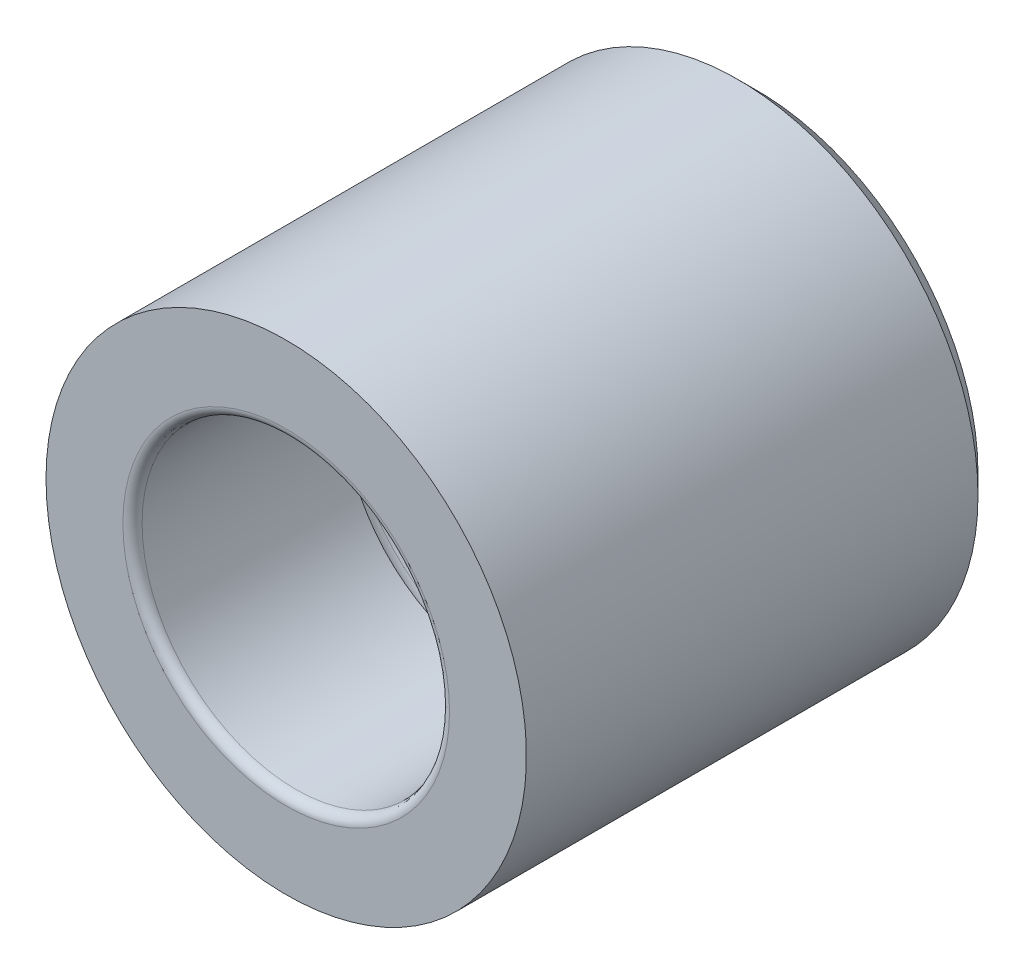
ISO-10303-21;
HEADER;
FILE_DESCRIPTION(('STEP AP214'),'2;1');
FILE_NAME('part.step','',(''),(''),'','','');
FILE_SCHEMA(('AUTOMOTIVE_DESIGN { 1 0 10303 214 1 1 1 1 }'));
ENDSEC;
DATA;
#1=APPLICATION_CONTEXT('core data for automotive mechanical design processes');
#2=APPLICATION_PROTOCOL_DEFINITION('international standard','automotive_design',2000,#1);
#3=PRODUCT_CONTEXT('',#1,'mechanical');
#4=PRODUCT('Part','Part','',(#3));
#5=PRODUCT_RELATED_PRODUCT_CATEGORY('part','',(#4));
#6=PRODUCT_DEFINITION_FORMATION('','',#4);
#7=PRODUCT_DEFINITION_CONTEXT('part definition',#1,'design');
#8=PRODUCT_DEFINITION('design','',#6,#7);
#9=PRODUCT_DEFINITION_SHAPE('','',#8);
#10=(LENGTH_UNIT() NAMED_UNIT(*) SI_UNIT(.MILLI.,.METRE.));
#11=(NAMED_UNIT(*) PLANE_ANGLE_UNIT() SI_UNIT($,.RADIAN.));
#12=(NAMED_UNIT(*) SI_UNIT($,.STERADIAN.) SOLID_ANGLE_UNIT());
#13=UNCERTAINTY_MEASURE_WITH_UNIT(LENGTH_MEASURE(1.E-05),#10,'distance_accuracy_value','');
#14=(GEOMETRIC_REPRESENTATION_CONTEXT(3) GLOBAL_UNCERTAINTY_ASSIGNED_CONTEXT((#13)) GLOBAL_UNIT_ASSIGNED_CONTEXT((#10,
#11,#12)) REPRESENTATION_CONTEXT('',''));
#15=CARTESIAN_POINT('',(0.,0.,0.));
#16=DIRECTION('',(0.,0.,1.));
#17=DIRECTION('',(1.,0.,0.));
#18=AXIS2_PLACEMENT_3D('',#15,#16,#17);
#19=CARTESIAN_POINT('',(0.,0.,-0.5));
#20=DIRECTION('',(0.,0.,-1.));
#21=DIRECTION('',(-1.,0.,0.));
#22=AXIS2_PLACEMENT_3D('',#19,#20,#21);
#23=PLANE('',#22);
#24=CARTESIAN_POINT('',(0.,0.,-0.5));
#25=DIRECTION('',(0.,0.,-1.));
#26=DIRECTION('',(-1.,0.,0.));
#27=AXIS2_PLACEMENT_3D('',#24,#25,#26);
#28=CIRCLE('',#27,8.5);
#29=CARTESIAN_POINT('',(-8.5,0.,-0.499999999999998));
#30=VERTEX_POINT('',#29);
#31=EDGE_CURVE('E50',#30,#30,#28,.T.);
#32=ORIENTED_EDGE('',*,*,#31,.T.);
#33=EDGE_LOOP('',(#32));
#34=FACE_BOUND('',#33,.T.);
#35=CARTESIAN_POINT('',(0.,0.,-0.5));
#36=DIRECTION('',(0.,0.,-1.));
#37=DIRECTION('',(-1.,0.,0.));
#38=AXIS2_PLACEMENT_3D('',#35,#36,#37);
#39=CIRCLE('',#38,12.5);
#40=CARTESIAN_POINT('',(-12.5,0.,-0.499999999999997));
#41=VERTEX_POINT('',#40);
#42=EDGE_CURVE('E63',#41,#41,#39,.T.);
#43=ORIENTED_EDGE('',*,*,#42,.F.);
#44=EDGE_LOOP('',(#43));
#45=FACE_BOUND('',#44,.T.);
#46=ADVANCED_FACE('F35',(#34,#45),#23,.F.);
#47=CARTESIAN_POINT('',(0.,0.,-0.5));
#48=DIRECTION('',(0.,0.,-1.));
#49=DIRECTION('',(-1.,0.,0.));
#50=AXIS2_PLACEMENT_3D('',#47,#48,#49);
#51=CYLINDRICAL_SURFACE('',#50,12.5);
#52=CARTESIAN_POINT('',(0.,0.,-24.));
#53=DIRECTION('',(0.,0.,1.));
#54=DIRECTION('',(1.,0.,0.));
#55=AXIS2_PLACEMENT_3D('',#52,#53,#54);
#56=CIRCLE('',#55,12.5);
#57=CARTESIAN_POINT('',(12.5,0.,-24.));
#58=VERTEX_POINT('',#57);
#59=EDGE_CURVE('E10',#58,#58,#56,.T.);
#60=ORIENTED_EDGE('',*,*,#59,.T.);
#61=EDGE_LOOP('',(#60));
#62=FACE_BOUND('',#61,.T.);
#63=ORIENTED_EDGE('',*,*,#42,.T.);
#64=EDGE_LOOP('',(#63));
#65=FACE_BOUND('',#64,.T.);
#66=ADVANCED_FACE('F79',(#62,#65),#51,.T.);
#67=CARTESIAN_POINT('',(0.,0.,-25.));
#68=DIRECTION('',(0.,0.,1.));
#69=DIRECTION('',(1.,0.,0.));
#70=AXIS2_PLACEMENT_3D('',#67,#68,#69);
#71=PLANE('',#70);
#72=CARTESIAN_POINT('',(0.,0.,-25.));
#73=DIRECTION('',(0.,0.,1.));
#74=DIRECTION('',(1.,0.,0.));
#75=AXIS2_PLACEMENT_3D('',#72,#73,#74);
#76=CIRCLE('',#75,11.5);
#77=CARTESIAN_POINT('',(11.5,0.,-25.));
#78=VERTEX_POINT('',#77);
#79=EDGE_CURVE('E42',#78,#78,#76,.F.);
#80=ORIENTED_EDGE('',*,*,#79,.T.);
#81=EDGE_LOOP('',(#80));
#82=FACE_BOUND('',#81,.T.);
#83=CARTESIAN_POINT('',(0.,0.,-25.));
#84=DIRECTION('',(0.,0.,-1.));
#85=DIRECTION('',(-1.,0.,0.));
#86=AXIS2_PLACEMENT_3D('',#83,#84,#85);
#87=CIRCLE('',#86,3.4);
#88=CARTESIAN_POINT('',(-3.4,0.,-25.));
#89=VERTEX_POINT('',#88);
#90=EDGE_CURVE('E70',#89,#89,#87,.T.);
#91=ORIENTED_EDGE('',*,*,#90,.F.);
#92=EDGE_LOOP('',(#91));
#93=FACE_BOUND('',#92,.T.);
#94=ADVANCED_FACE('F76',(#82,#93),#71,.F.);
#95=CARTESIAN_POINT('',(0.,0.,-14.));
#96=DIRECTION('',(0.,0.,1.));
#97=DIRECTION('',(1.,0.,0.));
#98=AXIS2_PLACEMENT_3D('',#95,#96,#97);
#99=PLANE('',#98);
#100=CARTESIAN_POINT('',(0.,0.,-14.));
#101=DIRECTION('',(0.,0.,1.));
#102=DIRECTION('',(1.,0.,0.));
#103=AXIS2_PLACEMENT_3D('',#100,#101,#102);
#104=CIRCLE('',#103,3.4);
#105=CARTESIAN_POINT('',(3.39999999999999,0.,-14.));
#106=VERTEX_POINT('',#105);
#107=EDGE_CURVE('E60',#106,#106,#104,.T.);
#108=ORIENTED_EDGE('',*,*,#107,.F.);
#109=EDGE_LOOP('',(#108));
#110=FACE_BOUND('',#109,.T.);
#111=CARTESIAN_POINT('',(0.,0.,-14.));
#112=DIRECTION('',(0.,0.,1.));
#113=DIRECTION('',(1.,0.,0.));
#114=AXIS2_PLACEMENT_3D('',#111,#112,#113);
#115=CIRCLE('',#114,8.);
#116=CARTESIAN_POINT('',(7.99999999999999,0.,-14.));
#117=VERTEX_POINT('',#116);
#118=EDGE_CURVE('E55',#117,#117,#115,.T.);
#119=ORIENTED_EDGE('',*,*,#118,.T.);
#120=EDGE_LOOP('',(#119));
#121=FACE_BOUND('',#120,.T.);
#122=ADVANCED_FACE('F78',(#110,#121),#99,.T.);
#123=CARTESIAN_POINT('',(0.,0.,-0.5));
#124=DIRECTION('',(0.,0.,-1.));
#125=DIRECTION('',(-1.,0.,0.));
#126=AXIS2_PLACEMENT_3D('',#123,#124,#125);
#127=CYLINDRICAL_SURFACE('',#126,8.);
#128=CARTESIAN_POINT('',(0.,0.,-1.));
#129=DIRECTION('',(0.,0.,-1.));
#130=DIRECTION('',(-1.,0.,0.));
#131=AXIS2_PLACEMENT_3D('',#128,#129,#130);
#132=CIRCLE('',#131,8.);
#133=CARTESIAN_POINT('',(-8.,0.,-0.999999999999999));
#134=VERTEX_POINT('',#133);
#135=EDGE_CURVE('E46',#134,#134,#132,.F.);
#136=ORIENTED_EDGE('',*,*,#135,.T.);
#137=EDGE_LOOP('',(#136));
#138=FACE_BOUND('',#137,.T.);
#139=CARTESIAN_POINT('',(0.,0.,-11.5));
#140=DIRECTION('',(0.,0.,-1.));
#141=DIRECTION('',(-1.,0.,0.));
#142=AXIS2_PLACEMENT_3D('',#139,#140,#141);
#143=CIRCLE('',#142,8.);
#144=CARTESIAN_POINT('',(-8.,0.,-11.5));
#145=VERTEX_POINT('',#144);
#146=EDGE_CURVE('E59',#145,#145,#143,.T.);
#147=ORIENTED_EDGE('',*,*,#146,.T.);
#148=EDGE_LOOP('',(#147));
#149=FACE_BOUND('',#148,.T.);
#150=ADVANCED_FACE('F85',(#138,#149),#127,.F.);
#151=CARTESIAN_POINT('',(0.,0.,-12.75));
#152=DIRECTION('',(0.,0.,1.));
#153=DIRECTION('',(1.,0.,0.));
#154=AXIS2_PLACEMENT_3D('',#151,#152,#153);
#155=TOROIDAL_SURFACE('',#154,8.,1.25);
#156=ORIENTED_EDGE('',*,*,#118,.F.);
#157=EDGE_LOOP('',(#156));
#158=FACE_BOUND('',#157,.T.);
#159=CARTESIAN_POINT('',(0.,0.,-12.75));
#160=DIRECTION('',(0.,0.,1.));
#161=DIRECTION('',(1.,0.,0.));
#162=AXIS2_PLACEMENT_3D('',#159,#160,#161);
#163=CIRCLE('',#162,9.25);
#164=CARTESIAN_POINT('',(9.24999999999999,0.,-12.75));
#165=VERTEX_POINT('',#164);
#166=EDGE_CURVE('E56',#165,#165,#163,.F.);
#167=ORIENTED_EDGE('',*,*,#166,.F.);
#168=EDGE_LOOP('',(#167));
#169=FACE_BOUND('',#168,.T.);
#170=ADVANCED_FACE('F99',(#158,#169),#155,.F.);
#171=CARTESIAN_POINT('',(0.,0.,-12.75));
#172=DIRECTION('',(0.,0.,-1.));
#173=DIRECTION('',(-1.,0.,0.));
#174=AXIS2_PLACEMENT_3D('',#171,#172,#173);
#175=TOROIDAL_SURFACE('',#174,8.,1.25);
#176=ORIENTED_EDGE('',*,*,#166,.T.);
#177=EDGE_LOOP('',(#176));
#178=FACE_BOUND('',#177,.T.);
#179=ORIENTED_EDGE('',*,*,#146,.F.);
#180=EDGE_LOOP('',(#179));
#181=FACE_BOUND('',#180,.T.);
#182=ADVANCED_FACE('F96',(#178,#181),#175,.F.);
#183=CARTESIAN_POINT('',(0.,0.,-25.));
#184=DIRECTION('',(0.,0.,-1.));
#185=DIRECTION('',(-1.,0.,0.));
#186=AXIS2_PLACEMENT_3D('',#183,#184,#185);
#187=CYLINDRICAL_SURFACE('',#186,3.4);
#188=ORIENTED_EDGE('',*,*,#107,.T.);
#189=EDGE_LOOP('',(#188));
#190=FACE_BOUND('',#189,.T.);
#191=ORIENTED_EDGE('',*,*,#90,.T.);
#192=EDGE_LOOP('',(#191));
#193=FACE_BOUND('',#192,.T.);
#194=ADVANCED_FACE('F74',(#190,#193),#187,.F.);
#195=CARTESIAN_POINT('',(0.,0.,-1.));
#196=DIRECTION('',(0.,0.,-1.));
#197=DIRECTION('',(-1.,0.,0.));
#198=AXIS2_PLACEMENT_3D('',#195,#196,#197);
#199=TOROIDAL_SURFACE('',#198,8.5,0.5);
#200=ORIENTED_EDGE('',*,*,#135,.F.);
#201=EDGE_LOOP('',(#200));
#202=FACE_BOUND('',#201,.T.);
#203=ORIENTED_EDGE('',*,*,#31,.F.);
#204=EDGE_LOOP('',(#203));
#205=FACE_BOUND('',#204,.T.);
#206=ADVANCED_FACE('F103',(#202,#205),#199,.T.);
#207=CARTESIAN_POINT('',(0.,0.,-25.));
#208=DIRECTION('',(0.,0.,1.));
#209=DIRECTION('',(1.,0.,0.));
#210=AXIS2_PLACEMENT_3D('',#207,#208,#209);
#211=CONICAL_SURFACE('',#210,11.5,0.785398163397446);
#212=ORIENTED_EDGE('',*,*,#59,.F.);
#213=EDGE_LOOP('',(#212));
#214=FACE_BOUND('',#213,.T.);
#215=ORIENTED_EDGE('',*,*,#79,.F.);
#216=EDGE_LOOP('',(#215));
#217=FACE_BOUND('',#216,.T.);
#218=ADVANCED_FACE('F37',(#214,#217),#211,.T.);
#219=CLOSED_SHELL('',(#46,#66,#94,#122,#150,#170,#182,#194,#206,#218));
#220=MANIFOLD_SOLID_BREP('B2',#219);
#221=ADVANCED_BREP_SHAPE_REPRESENTATION('',(#18,#220),#14);
#222=SHAPE_DEFINITION_REPRESENTATION(#9,#221);
ENDSEC;
END-ISO-10303-21;
